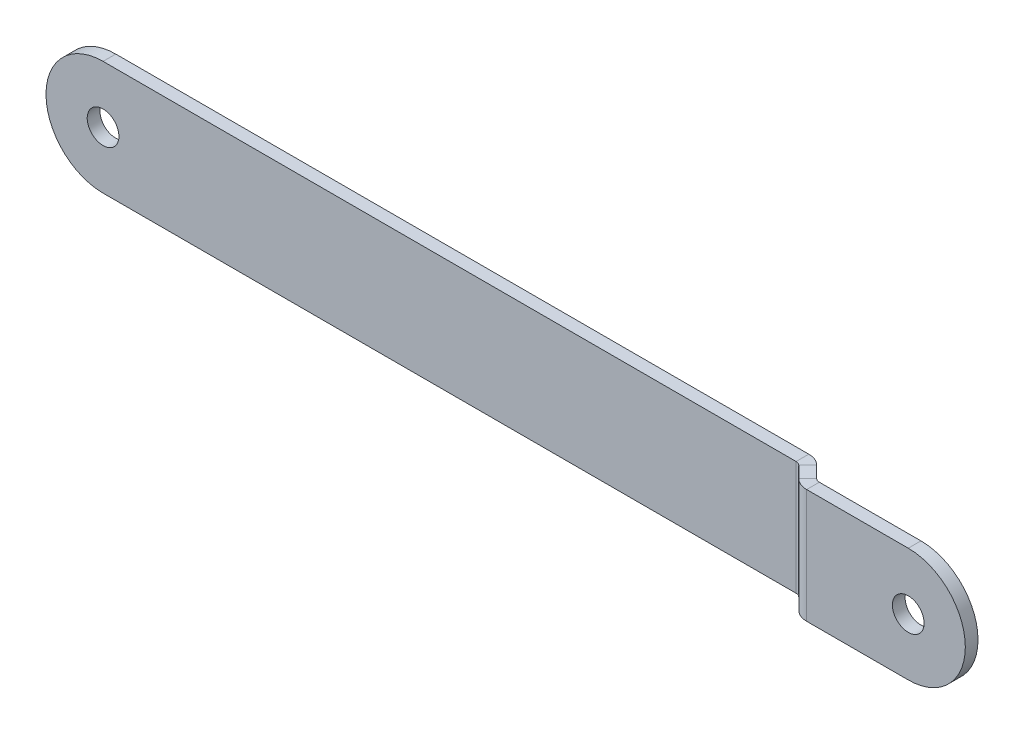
ISO-10303-21;
HEADER;
FILE_DESCRIPTION(('STEP AP214'),'2;1');
FILE_NAME('part.step','',(''),(''),'','','');
FILE_SCHEMA(('AUTOMOTIVE_DESIGN { 1 0 10303 214 1 1 1 1 }'));
ENDSEC;
DATA;
#1=APPLICATION_CONTEXT('core data for automotive mechanical design processes');
#2=APPLICATION_PROTOCOL_DEFINITION('international standard','automotive_design',2000,#1);
#3=PRODUCT_CONTEXT('',#1,'mechanical');
#4=PRODUCT('Part','Part','',(#3));
#5=PRODUCT_RELATED_PRODUCT_CATEGORY('part','',(#4));
#6=PRODUCT_DEFINITION_FORMATION('','',#4);
#7=PRODUCT_DEFINITION_CONTEXT('part definition',#1,'design');
#8=PRODUCT_DEFINITION('design','',#6,#7);
#9=PRODUCT_DEFINITION_SHAPE('','',#8);
#10=(LENGTH_UNIT() NAMED_UNIT(*) SI_UNIT(.MILLI.,.METRE.));
#11=(NAMED_UNIT(*) PLANE_ANGLE_UNIT() SI_UNIT($,.RADIAN.));
#12=(NAMED_UNIT(*) SI_UNIT($,.STERADIAN.) SOLID_ANGLE_UNIT());
#13=UNCERTAINTY_MEASURE_WITH_UNIT(LENGTH_MEASURE(1.E-05),#10,'distance_accuracy_value','');
#14=(GEOMETRIC_REPRESENTATION_CONTEXT(3) GLOBAL_UNCERTAINTY_ASSIGNED_CONTEXT((#13)) GLOBAL_UNIT_ASSIGNED_CONTEXT((#10,
#11,#12)) REPRESENTATION_CONTEXT('',''));
#15=CARTESIAN_POINT('',(0.,0.,0.));
#16=DIRECTION('',(0.,0.,1.));
#17=DIRECTION('',(1.,0.,0.));
#18=AXIS2_PLACEMENT_3D('',#15,#16,#17);
#19=CARTESIAN_POINT('',(-33.2464621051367,0.,-77.9742376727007));
#20=DIRECTION('',(-0.707106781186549,0.,0.707106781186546));
#21=DIRECTION('',(0.707106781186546,0.,0.707106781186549));
#22=AXIS2_PLACEMENT_3D('',#19,#20,#21);
#23=PLANE('',#22);
#24=DIRECTION('',(0.707106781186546,0.,0.707106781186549));
#25=VECTOR('',#24,1.);
#26=CARTESIAN_POINT('',(-33.2464621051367,-9.00000000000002,-77.9742376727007));
#27=LINE('',#26,#25);
#28=CARTESIAN_POINT('',(45.0206687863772,-9.,0.292893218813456));
#29=VERTEX_POINT('',#28);
#30=CARTESIAN_POINT('',(46.8490959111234,-9.,2.12132034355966));
#31=VERTEX_POINT('',#30);
#32=EDGE_CURVE('E204',#29,#31,#27,.T.);
#33=ORIENTED_EDGE('',*,*,#32,.T.);
#34=DIRECTION('',(0.,1.,0.));
#35=VECTOR('',#34,1.);
#36=CARTESIAN_POINT('',(46.8490959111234,0.,2.12132034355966));
#37=LINE('',#36,#35);
#38=CARTESIAN_POINT('',(46.8490959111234,9.00000000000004,2.12132034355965));
#39=VERTEX_POINT('',#38);
#40=EDGE_CURVE('E58',#31,#39,#37,.T.);
#41=ORIENTED_EDGE('',*,*,#40,.T.);
#42=DIRECTION('',(-0.707106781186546,0.,-0.707106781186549));
#43=VECTOR('',#42,1.);
#44=CARTESIAN_POINT('',(-33.2464621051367,9.00000000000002,-77.9742376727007));
#45=LINE('',#44,#43);
#46=CARTESIAN_POINT('',(45.0206687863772,9.00000000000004,0.292893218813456));
#47=VERTEX_POINT('',#46);
#48=EDGE_CURVE('E74',#39,#47,#45,.T.);
#49=ORIENTED_EDGE('',*,*,#48,.T.);
#50=DIRECTION('',(0.,1.,0.));
#51=VECTOR('',#50,1.);
#52=CARTESIAN_POINT('',(45.0206687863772,0.,0.292893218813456));
#53=LINE('',#52,#51);
#54=EDGE_CURVE('E244',#29,#47,#53,.T.);
#55=ORIENTED_EDGE('',*,*,#54,.F.);
#56=EDGE_LOOP('',(#33,#41,#49,#55));
#57=FACE_BOUND('',#56,.T.);
#58=ADVANCED_FACE('F49',(#57),#23,.T.);
#59=CARTESIAN_POINT('',(-31.8322485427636,-9.00000000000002,-79.3884512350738));
#60=DIRECTION('',(0.,-1.,0.));
#61=DIRECTION('',(0.707106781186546,0.,0.707106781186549));
#62=AXIS2_PLACEMENT_3D('',#59,#60,#61);
#63=PLANE('',#62);
#64=DIRECTION('',(0.707106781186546,0.,0.707106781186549));
#65=VECTOR('',#64,1.);
#66=CARTESIAN_POINT('',(-31.8322485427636,-9.00000000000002,-79.3884512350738));
#67=LINE('',#66,#65);
#68=CARTESIAN_POINT('',(46.4348823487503,-9.,-1.12132034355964));
#69=VERTEX_POINT('',#68);
#70=CARTESIAN_POINT('',(48.2633094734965,-9.,0.707106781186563));
#71=VERTEX_POINT('',#70);
#72=EDGE_CURVE('E256',#69,#71,#67,.T.);
#73=ORIENTED_EDGE('',*,*,#72,.T.);
#74=DIRECTION('',(-0.707106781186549,0.,0.707106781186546));
#75=VECTOR('',#74,1.);
#76=CARTESIAN_POINT('',(48.2633094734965,-9.,0.707106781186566));
#77=LINE('',#76,#75);
#78=EDGE_CURVE('E12',#71,#31,#77,.T.);
#79=ORIENTED_EDGE('',*,*,#78,.T.);
#80=ORIENTED_EDGE('',*,*,#32,.F.);
#81=DIRECTION('',(-0.707106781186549,0.,0.707106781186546));
#82=VECTOR('',#81,1.);
#83=CARTESIAN_POINT('',(46.4348823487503,-9.,-1.12132034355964));
#84=LINE('',#83,#82);
#85=EDGE_CURVE('E241',#69,#29,#84,.T.);
#86=ORIENTED_EDGE('',*,*,#85,.F.);
#87=EDGE_LOOP('',(#73,#79,#80,#86));
#88=FACE_BOUND('',#87,.T.);
#89=ADVANCED_FACE('F51',(#88),#63,.T.);
#90=CARTESIAN_POINT('',(-31.8322485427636,9.00000000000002,-79.3884512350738));
#91=DIRECTION('',(0.,1.,0.));
#92=DIRECTION('',(-0.707106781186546,0.,-0.707106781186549));
#93=AXIS2_PLACEMENT_3D('',#90,#91,#92);
#94=PLANE('',#93);
#95=ORIENTED_EDGE('',*,*,#48,.F.);
#96=DIRECTION('',(0.707106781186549,0.,-0.707106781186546));
#97=VECTOR('',#96,1.);
#98=CARTESIAN_POINT('',(48.2633094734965,9.00000000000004,0.707106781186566));
#99=LINE('',#98,#97);
#100=CARTESIAN_POINT('',(48.2633094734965,9.00000000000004,0.707106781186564));
#101=VERTEX_POINT('',#100);
#102=EDGE_CURVE('E252',#39,#101,#99,.T.);
#103=ORIENTED_EDGE('',*,*,#102,.T.);
#104=DIRECTION('',(-0.707106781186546,0.,-0.707106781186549));
#105=VECTOR('',#104,1.);
#106=CARTESIAN_POINT('',(-31.8322485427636,9.00000000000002,-79.3884512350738));
#107=LINE('',#106,#105);
#108=CARTESIAN_POINT('',(46.4348823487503,9.00000000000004,-1.12132034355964));
#109=VERTEX_POINT('',#108);
#110=EDGE_CURVE('E53',#101,#109,#107,.T.);
#111=ORIENTED_EDGE('',*,*,#110,.T.);
#112=DIRECTION('',(0.707106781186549,0.,-0.707106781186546));
#113=VECTOR('',#112,1.);
#114=CARTESIAN_POINT('',(46.4348823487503,9.00000000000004,-1.12132034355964));
#115=LINE('',#114,#113);
#116=EDGE_CURVE('E247',#47,#109,#115,.T.);
#117=ORIENTED_EDGE('',*,*,#116,.F.);
#118=EDGE_LOOP('',(#95,#103,#111,#117));
#119=FACE_BOUND('',#118,.T.);
#120=ADVANCED_FACE('F275',(#119),#94,.T.);
#121=CARTESIAN_POINT('',(-31.8322485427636,0.,-79.3884512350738));
#122=DIRECTION('',(-0.707106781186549,0.,0.707106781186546));
#123=DIRECTION('',(0.707106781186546,0.,0.707106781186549));
#124=AXIS2_PLACEMENT_3D('',#121,#122,#123);
#125=PLANE('',#124);
#126=DIRECTION('',(0.,1.,0.));
#127=VECTOR('',#126,1.);
#128=CARTESIAN_POINT('',(48.2633094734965,0.,0.707106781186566));
#129=LINE('',#128,#127);
#130=EDGE_CURVE('E250',#71,#101,#129,.T.);
#131=ORIENTED_EDGE('',*,*,#130,.F.);
#132=ORIENTED_EDGE('',*,*,#72,.F.);
#133=DIRECTION('',(0.,1.,0.));
#134=VECTOR('',#133,1.);
#135=CARTESIAN_POINT('',(46.4348823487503,0.,-1.12132034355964));
#136=LINE('',#135,#134);
#137=EDGE_CURVE('E239',#69,#109,#136,.T.);
#138=ORIENTED_EDGE('',*,*,#137,.T.);
#139=ORIENTED_EDGE('',*,*,#110,.F.);
#140=EDGE_LOOP('',(#131,#132,#138,#139));
#141=FACE_BOUND('',#140,.T.);
#142=ADVANCED_FACE('F271',(#141),#125,.F.);
#143=CARTESIAN_POINT('',(-65.,0.,-2.));
#144=DIRECTION('',(0.,0.,1.));
#145=DIRECTION('',(1.,0.,0.));
#146=AXIS2_PLACEMENT_3D('',#143,#144,#145);
#147=CYLINDRICAL_SURFACE('',#146,2.49999999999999);
#148=CARTESIAN_POINT('',(-65.,0.,-2.));
#149=DIRECTION('',(0.,0.,1.));
#150=DIRECTION('',(1.,0.,0.));
#151=AXIS2_PLACEMENT_3D('',#148,#149,#150);
#152=CIRCLE('',#151,2.49999999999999);
#153=CARTESIAN_POINT('',(-62.5,0.,-2.));
#154=VERTEX_POINT('',#153);
#155=EDGE_CURVE('E227',#154,#154,#152,.T.);
#156=ORIENTED_EDGE('',*,*,#155,.F.);
#157=EDGE_LOOP('',(#156));
#158=FACE_BOUND('',#157,.T.);
#159=CARTESIAN_POINT('',(-65.,0.,0.));
#160=DIRECTION('',(0.,0.,1.));
#161=DIRECTION('',(1.,0.,0.));
#162=AXIS2_PLACEMENT_3D('',#159,#160,#161);
#163=CIRCLE('',#162,2.49999999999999);
#164=CARTESIAN_POINT('',(-62.5,0.,0.));
#165=VERTEX_POINT('',#164);
#166=EDGE_CURVE('E235',#165,#165,#163,.T.);
#167=ORIENTED_EDGE('',*,*,#166,.T.);
#168=EDGE_LOOP('',(#167));
#169=FACE_BOUND('',#168,.T.);
#170=ADVANCED_FACE('F317',(#158,#169),#147,.F.);
#171=CARTESIAN_POINT('',(-65.,0.,-2.));
#172=DIRECTION('',(0.,0.,1.));
#173=DIRECTION('',(1.,0.,0.));
#174=AXIS2_PLACEMENT_3D('',#171,#172,#173);
#175=CYLINDRICAL_SURFACE('',#174,9.00000000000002);
#176=CARTESIAN_POINT('',(-65.,0.,0.));
#177=DIRECTION('',(0.,0.,1.));
#178=DIRECTION('',(1.,0.,0.));
#179=AXIS2_PLACEMENT_3D('',#176,#177,#178);
#180=CIRCLE('',#179,9.00000000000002);
#181=CARTESIAN_POINT('',(-65.,9.00000000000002,0.));
#182=VERTEX_POINT('',#181);
#183=CARTESIAN_POINT('',(-65.,-9.00000000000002,0.));
#184=VERTEX_POINT('',#183);
#185=EDGE_CURVE('E210',#182,#184,#180,.T.);
#186=ORIENTED_EDGE('',*,*,#185,.F.);
#187=DIRECTION('',(0.,0.,1.));
#188=VECTOR('',#187,1.);
#189=CARTESIAN_POINT('',(-65.,9.00000000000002,-2.));
#190=LINE('',#189,#188);
#191=CARTESIAN_POINT('',(-65.,9.00000000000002,-2.));
#192=VERTEX_POINT('',#191);
#193=EDGE_CURVE('E201',#192,#182,#190,.T.);
#194=ORIENTED_EDGE('',*,*,#193,.F.);
#195=CARTESIAN_POINT('',(-65.,0.,-2.));
#196=DIRECTION('',(0.,0.,1.));
#197=DIRECTION('',(1.,0.,0.));
#198=AXIS2_PLACEMENT_3D('',#195,#196,#197);
#199=CIRCLE('',#198,9.00000000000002);
#200=CARTESIAN_POINT('',(-65.,-9.00000000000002,-2.));
#201=VERTEX_POINT('',#200);
#202=EDGE_CURVE('E232',#192,#201,#199,.T.);
#203=ORIENTED_EDGE('',*,*,#202,.T.);
#204=DIRECTION('',(0.,0.,1.));
#205=VECTOR('',#204,1.);
#206=CARTESIAN_POINT('',(-65.,-9.00000000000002,-2.));
#207=LINE('',#206,#205);
#208=EDGE_CURVE('E230',#201,#184,#207,.T.);
#209=ORIENTED_EDGE('',*,*,#208,.T.);
#210=EDGE_LOOP('',(#186,#194,#203,#209));
#211=FACE_BOUND('',#210,.T.);
#212=ADVANCED_FACE('F334',(#211),#175,.T.);
#213=CARTESIAN_POINT('',(-65.,0.,-2.));
#214=DIRECTION('',(0.,0.,1.));
#215=DIRECTION('',(1.,0.,0.));
#216=AXIS2_PLACEMENT_3D('',#213,#214,#215);
#217=PLANE('',#216);
#218=DIRECTION('',(0.,1.,0.));
#219=VECTOR('',#218,1.);
#220=CARTESIAN_POINT('',(44.3135620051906,0.,-2.));
#221=LINE('',#220,#219);
#222=CARTESIAN_POINT('',(44.3135620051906,-9.,-2.));
#223=VERTEX_POINT('',#222);
#224=CARTESIAN_POINT('',(44.3135620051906,9.00000000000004,-2.));
#225=VERTEX_POINT('',#224);
#226=EDGE_CURVE('E197',#223,#225,#221,.T.);
#227=ORIENTED_EDGE('',*,*,#226,.F.);
#228=DIRECTION('',(1.,0.,0.));
#229=VECTOR('',#228,1.);
#230=CARTESIAN_POINT('',(-65.,-9.00000000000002,-2.));
#231=LINE('',#230,#229);
#232=EDGE_CURVE('E224',#201,#223,#231,.T.);
#233=ORIENTED_EDGE('',*,*,#232,.F.);
#234=ORIENTED_EDGE('',*,*,#202,.F.);
#235=DIRECTION('',(-1.,0.,0.));
#236=VECTOR('',#235,1.);
#237=CARTESIAN_POINT('',(-65.,9.00000000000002,-2.));
#238=LINE('',#237,#236);
#239=EDGE_CURVE('E205',#225,#192,#238,.T.);
#240=ORIENTED_EDGE('',*,*,#239,.F.);
#241=EDGE_LOOP('',(#227,#233,#234,#240));
#242=FACE_BOUND('',#241,.T.);
#243=ORIENTED_EDGE('',*,*,#155,.T.);
#244=EDGE_LOOP('',(#243));
#245=FACE_BOUND('',#244,.T.);
#246=ADVANCED_FACE('F330',(#242,#245),#217,.F.);
#247=CARTESIAN_POINT('',(-65.,-9.00000000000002,-2.));
#248=DIRECTION('',(0.,-1.,0.));
#249=DIRECTION('',(1.,0.,0.));
#250=AXIS2_PLACEMENT_3D('',#247,#248,#249);
#251=PLANE('',#250);
#252=ORIENTED_EDGE('',*,*,#232,.T.);
#253=DIRECTION('',(0.,0.,1.));
#254=VECTOR('',#253,1.);
#255=CARTESIAN_POINT('',(44.3135620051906,-9.,-2.));
#256=LINE('',#255,#254);
#257=CARTESIAN_POINT('',(44.3135620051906,-9.,0.));
#258=VERTEX_POINT('',#257);
#259=EDGE_CURVE('E221',#223,#258,#256,.T.);
#260=ORIENTED_EDGE('',*,*,#259,.T.);
#261=DIRECTION('',(1.,0.,0.));
#262=VECTOR('',#261,1.);
#263=CARTESIAN_POINT('',(-65.,-9.00000000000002,0.));
#264=LINE('',#263,#262);
#265=EDGE_CURVE('E218',#184,#258,#264,.T.);
#266=ORIENTED_EDGE('',*,*,#265,.F.);
#267=ORIENTED_EDGE('',*,*,#208,.F.);
#268=EDGE_LOOP('',(#252,#260,#266,#267));
#269=FACE_BOUND('',#268,.T.);
#270=ADVANCED_FACE('F326',(#269),#251,.T.);
#271=CARTESIAN_POINT('',(-65.,0.,0.));
#272=DIRECTION('',(0.,0.,1.));
#273=DIRECTION('',(1.,0.,0.));
#274=AXIS2_PLACEMENT_3D('',#271,#272,#273);
#275=PLANE('',#274);
#276=ORIENTED_EDGE('',*,*,#166,.F.);
#277=EDGE_LOOP('',(#276));
#278=FACE_BOUND('',#277,.T.);
#279=ORIENTED_EDGE('',*,*,#265,.T.);
#280=DIRECTION('',(0.,1.,0.));
#281=VECTOR('',#280,1.);
#282=CARTESIAN_POINT('',(44.3135620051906,0.,0.));
#283=LINE('',#282,#281);
#284=CARTESIAN_POINT('',(44.3135620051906,9.00000000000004,0.));
#285=VERTEX_POINT('',#284);
#286=EDGE_CURVE('E215',#258,#285,#283,.T.);
#287=ORIENTED_EDGE('',*,*,#286,.T.);
#288=DIRECTION('',(-1.,0.,0.));
#289=VECTOR('',#288,1.);
#290=CARTESIAN_POINT('',(-65.,9.00000000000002,0.));
#291=LINE('',#290,#289);
#292=EDGE_CURVE('E213',#285,#182,#291,.T.);
#293=ORIENTED_EDGE('',*,*,#292,.T.);
#294=ORIENTED_EDGE('',*,*,#185,.T.);
#295=EDGE_LOOP('',(#279,#287,#293,#294));
#296=FACE_BOUND('',#295,.T.);
#297=ADVANCED_FACE('F322',(#278,#296),#275,.T.);
#298=CARTESIAN_POINT('',(-65.,9.00000000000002,-2.));
#299=DIRECTION('',(0.,1.,0.));
#300=DIRECTION('',(-1.,0.,0.));
#301=AXIS2_PLACEMENT_3D('',#298,#299,#300);
#302=PLANE('',#301);
#303=ORIENTED_EDGE('',*,*,#292,.F.);
#304=DIRECTION('',(0.,0.,-1.));
#305=VECTOR('',#304,1.);
#306=CARTESIAN_POINT('',(44.3135620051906,9.00000000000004,-2.));
#307=LINE('',#306,#305);
#308=EDGE_CURVE('E207',#285,#225,#307,.T.);
#309=ORIENTED_EDGE('',*,*,#308,.T.);
#310=ORIENTED_EDGE('',*,*,#239,.T.);
#311=ORIENTED_EDGE('',*,*,#193,.T.);
#312=EDGE_LOOP('',(#303,#309,#310,#311));
#313=FACE_BOUND('',#312,.T.);
#314=ADVANCED_FACE('F318',(#313),#302,.T.);
#315=CARTESIAN_POINT('',(44.3135620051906,-9.,1.));
#316=DIRECTION('',(0.,-1.,0.));
#317=DIRECTION('',(0.,0.,-1.));
#318=AXIS2_PLACEMENT_3D('',#315,#316,#317);
#319=PLANE('',#318);
#320=ORIENTED_EDGE('',*,*,#85,.T.);
#321=CARTESIAN_POINT('',(44.3135620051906,-9.,1.));
#322=DIRECTION('',(0.,-1.,0.));
#323=DIRECTION('',(0.,0.,-1.));
#324=AXIS2_PLACEMENT_3D('',#321,#322,#323);
#325=CIRCLE('',#324,1.);
#326=EDGE_CURVE('E186',#29,#258,#325,.F.);
#327=ORIENTED_EDGE('',*,*,#326,.T.);
#328=ORIENTED_EDGE('',*,*,#259,.F.);
#329=CARTESIAN_POINT('',(44.3135620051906,-9.,1.));
#330=DIRECTION('',(0.,1.,0.));
#331=DIRECTION('',(0.,0.,-1.));
#332=AXIS2_PLACEMENT_3D('',#329,#330,#331);
#333=CIRCLE('',#332,3.);
#334=EDGE_CURVE('E190',#69,#223,#333,.T.);
#335=ORIENTED_EDGE('',*,*,#334,.F.);
#336=EDGE_LOOP('',(#320,#327,#328,#335));
#337=FACE_BOUND('',#336,.T.);
#338=ADVANCED_FACE('F321',(#337),#319,.T.);
#339=CARTESIAN_POINT('',(44.3135620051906,9.00000000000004,1.));
#340=DIRECTION('',(0.,1.,0.));
#341=DIRECTION('',(0.,0.,1.));
#342=AXIS2_PLACEMENT_3D('',#339,#340,#341);
#343=PLANE('',#342);
#344=ORIENTED_EDGE('',*,*,#308,.F.);
#345=CARTESIAN_POINT('',(44.3135620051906,9.00000000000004,1.));
#346=DIRECTION('',(0.,-1.,0.));
#347=DIRECTION('',(0.,0.,-1.));
#348=AXIS2_PLACEMENT_3D('',#345,#346,#347);
#349=CIRCLE('',#348,1.);
#350=EDGE_CURVE('E194',#285,#47,#349,.T.);
#351=ORIENTED_EDGE('',*,*,#350,.T.);
#352=ORIENTED_EDGE('',*,*,#116,.T.);
#353=CARTESIAN_POINT('',(44.3135620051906,9.00000000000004,1.));
#354=DIRECTION('',(0.,-1.,0.));
#355=DIRECTION('',(0.,0.,1.));
#356=AXIS2_PLACEMENT_3D('',#353,#354,#355);
#357=CIRCLE('',#356,3.);
#358=EDGE_CURVE('E193',#225,#109,#357,.T.);
#359=ORIENTED_EDGE('',*,*,#358,.F.);
#360=EDGE_LOOP('',(#344,#351,#352,#359));
#361=FACE_BOUND('',#360,.T.);
#362=ADVANCED_FACE('F344',(#361),#343,.T.);
#363=CARTESIAN_POINT('',(44.3135620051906,18.162730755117,1.));
#364=DIRECTION('',(0.,-1.,0.));
#365=DIRECTION('',(0.,0.,-1.));
#366=AXIS2_PLACEMENT_3D('',#363,#364,#365);
#367=CYLINDRICAL_SURFACE('',#366,3.);
#368=ORIENTED_EDGE('',*,*,#358,.T.);
#369=ORIENTED_EDGE('',*,*,#137,.F.);
#370=ORIENTED_EDGE('',*,*,#334,.T.);
#371=ORIENTED_EDGE('',*,*,#226,.T.);
#372=EDGE_LOOP('',(#368,#369,#370,#371));
#373=FACE_BOUND('',#372,.T.);
#374=ADVANCED_FACE('F348',(#373),#367,.T.);
#375=CARTESIAN_POINT('',(44.3135620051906,18.162730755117,1.));
#376=DIRECTION('',(0.,-1.,0.));
#377=DIRECTION('',(0.,0.,-1.));
#378=AXIS2_PLACEMENT_3D('',#375,#376,#377);
#379=CYLINDRICAL_SURFACE('',#378,1.);
#380=ORIENTED_EDGE('',*,*,#350,.F.);
#381=ORIENTED_EDGE('',*,*,#286,.F.);
#382=ORIENTED_EDGE('',*,*,#326,.F.);
#383=ORIENTED_EDGE('',*,*,#54,.T.);
#384=EDGE_LOOP('',(#380,#381,#382,#383));
#385=FACE_BOUND('',#384,.T.);
#386=ADVANCED_FACE('F350',(#385),#379,.F.);
#387=CARTESIAN_POINT('',(48.970416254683,-9.,0.));
#388=DIRECTION('',(0.,1.,0.));
#389=DIRECTION('',(0.,0.,1.));
#390=AXIS2_PLACEMENT_3D('',#387,#388,#389);
#391=PLANE('',#390);
#392=DIRECTION('',(0.,0.,1.));
#393=VECTOR('',#392,1.);
#394=CARTESIAN_POINT('',(48.970416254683,-9.,1.00000000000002));
#395=LINE('',#394,#393);
#396=CARTESIAN_POINT('',(48.970416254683,-9.,1.00000000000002));
#397=VERTEX_POINT('',#396);
#398=CARTESIAN_POINT('',(48.970416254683,-9.,3.00000000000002));
#399=VERTEX_POINT('',#398);
#400=EDGE_CURVE('E148',#397,#399,#395,.T.);
#401=ORIENTED_EDGE('',*,*,#400,.T.);
#402=CARTESIAN_POINT('',(48.970416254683,-9.,0.));
#403=DIRECTION('',(0.,-1.,0.));
#404=DIRECTION('',(0.,0.,-1.));
#405=AXIS2_PLACEMENT_3D('',#402,#403,#404);
#406=CIRCLE('',#405,3.);
#407=EDGE_CURVE('E66',#399,#31,#406,.T.);
#408=ORIENTED_EDGE('',*,*,#407,.T.);
#409=ORIENTED_EDGE('',*,*,#78,.F.);
#410=CARTESIAN_POINT('',(48.970416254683,-9.,0.));
#411=DIRECTION('',(0.,-1.,0.));
#412=DIRECTION('',(0.,0.,1.));
#413=AXIS2_PLACEMENT_3D('',#410,#411,#412);
#414=CIRCLE('',#413,1.);
#415=EDGE_CURVE('E179',#397,#71,#414,.T.);
#416=ORIENTED_EDGE('',*,*,#415,.F.);
#417=EDGE_LOOP('',(#401,#408,#409,#416));
#418=FACE_BOUND('',#417,.T.);
#419=ADVANCED_FACE('F262',(#418),#391,.F.);
#420=CARTESIAN_POINT('',(48.970416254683,9.00000000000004,0.));
#421=DIRECTION('',(0.,-1.,0.));
#422=DIRECTION('',(0.,0.,-1.));
#423=AXIS2_PLACEMENT_3D('',#420,#421,#422);
#424=PLANE('',#423);
#425=ORIENTED_EDGE('',*,*,#102,.F.);
#426=CARTESIAN_POINT('',(48.970416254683,9.00000000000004,0.));
#427=DIRECTION('',(0.,-1.,0.));
#428=DIRECTION('',(0.,0.,-1.));
#429=AXIS2_PLACEMENT_3D('',#426,#427,#428);
#430=CIRCLE('',#429,3.);
#431=CARTESIAN_POINT('',(48.970416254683,9.00000000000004,3.00000000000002));
#432=VERTEX_POINT('',#431);
#433=EDGE_CURVE('E183',#39,#432,#430,.F.);
#434=ORIENTED_EDGE('',*,*,#433,.T.);
#435=DIRECTION('',(0.,0.,-1.));
#436=VECTOR('',#435,1.);
#437=CARTESIAN_POINT('',(48.970416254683,9.00000000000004,1.00000000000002));
#438=LINE('',#437,#436);
#439=CARTESIAN_POINT('',(48.970416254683,9.00000000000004,1.00000000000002));
#440=VERTEX_POINT('',#439);
#441=EDGE_CURVE('E167',#432,#440,#438,.T.);
#442=ORIENTED_EDGE('',*,*,#441,.T.);
#443=CARTESIAN_POINT('',(48.970416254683,9.00000000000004,0.));
#444=DIRECTION('',(0.,1.,0.));
#445=DIRECTION('',(0.,0.,-1.));
#446=AXIS2_PLACEMENT_3D('',#443,#444,#445);
#447=CIRCLE('',#446,1.);
#448=EDGE_CURVE('E182',#101,#440,#447,.T.);
#449=ORIENTED_EDGE('',*,*,#448,.F.);
#450=EDGE_LOOP('',(#425,#434,#442,#449));
#451=FACE_BOUND('',#450,.T.);
#452=ADVANCED_FACE('F278',(#451),#424,.F.);
#453=CARTESIAN_POINT('',(48.970416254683,18.3132818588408,0.));
#454=DIRECTION('',(0.,-1.,0.));
#455=DIRECTION('',(0.,0.,-1.));
#456=AXIS2_PLACEMENT_3D('',#453,#454,#455);
#457=CYLINDRICAL_SURFACE('',#456,1.);
#458=ORIENTED_EDGE('',*,*,#448,.T.);
#459=DIRECTION('',(0.,1.,0.));
#460=VECTOR('',#459,1.);
#461=CARTESIAN_POINT('',(48.970416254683,0.,1.00000000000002));
#462=LINE('',#461,#460);
#463=EDGE_CURVE('E268',#397,#440,#462,.T.);
#464=ORIENTED_EDGE('',*,*,#463,.F.);
#465=ORIENTED_EDGE('',*,*,#415,.T.);
#466=ORIENTED_EDGE('',*,*,#130,.T.);
#467=EDGE_LOOP('',(#458,#464,#465,#466));
#468=FACE_BOUND('',#467,.T.);
#469=ADVANCED_FACE('F266',(#468),#457,.F.);
#470=CARTESIAN_POINT('',(48.970416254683,18.3132818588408,0.));
#471=DIRECTION('',(0.,-1.,0.));
#472=DIRECTION('',(0.,0.,-1.));
#473=AXIS2_PLACEMENT_3D('',#470,#471,#472);
#474=CYLINDRICAL_SURFACE('',#473,3.);
#475=ORIENTED_EDGE('',*,*,#433,.F.);
#476=ORIENTED_EDGE('',*,*,#40,.F.);
#477=ORIENTED_EDGE('',*,*,#407,.F.);
#478=DIRECTION('',(0.,1.,0.));
#479=VECTOR('',#478,1.);
#480=CARTESIAN_POINT('',(48.970416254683,0.,3.00000000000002));
#481=LINE('',#480,#479);
#482=EDGE_CURVE('E172',#399,#432,#481,.T.);
#483=ORIENTED_EDGE('',*,*,#482,.T.);
#484=EDGE_LOOP('',(#475,#476,#477,#483));
#485=FACE_BOUND('',#484,.T.);
#486=ADVANCED_FACE('F280',(#485),#474,.T.);
#487=CARTESIAN_POINT('',(65.,0.,1.00000000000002));
#488=DIRECTION('',(0.,0.,1.));
#489=DIRECTION('',(1.,0.,0.));
#490=AXIS2_PLACEMENT_3D('',#487,#488,#489);
#491=CYLINDRICAL_SURFACE('',#490,9.00000000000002);
#492=CARTESIAN_POINT('',(65.,0.,3.00000000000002));
#493=DIRECTION('',(0.,0.,1.));
#494=DIRECTION('',(1.,0.,0.));
#495=AXIS2_PLACEMENT_3D('',#492,#493,#494);
#496=CIRCLE('',#495,9.00000000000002);
#497=CARTESIAN_POINT('',(65.,-9.,3.00000000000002));
#498=VERTEX_POINT('',#497);
#499=CARTESIAN_POINT('',(65.,9.00000000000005,3.00000000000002));
#500=VERTEX_POINT('',#499);
#501=EDGE_CURVE('E161',#498,#500,#496,.T.);
#502=ORIENTED_EDGE('',*,*,#501,.F.);
#503=DIRECTION('',(0.,0.,1.));
#504=VECTOR('',#503,1.);
#505=CARTESIAN_POINT('',(65.,-9.,1.00000000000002));
#506=LINE('',#505,#504);
#507=CARTESIAN_POINT('',(65.,-9.,1.00000000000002));
#508=VERTEX_POINT('',#507);
#509=EDGE_CURVE('E146',#508,#498,#506,.T.);
#510=ORIENTED_EDGE('',*,*,#509,.F.);
#511=CARTESIAN_POINT('',(65.,0.,1.00000000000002));
#512=DIRECTION('',(0.,0.,1.));
#513=DIRECTION('',(1.,0.,0.));
#514=AXIS2_PLACEMENT_3D('',#511,#512,#513);
#515=CIRCLE('',#514,9.00000000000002);
#516=CARTESIAN_POINT('',(65.,9.00000000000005,1.00000000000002));
#517=VERTEX_POINT('',#516);
#518=EDGE_CURVE('E159',#508,#517,#515,.T.);
#519=ORIENTED_EDGE('',*,*,#518,.T.);
#520=DIRECTION('',(0.,0.,1.));
#521=VECTOR('',#520,1.);
#522=CARTESIAN_POINT('',(65.,9.00000000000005,1.00000000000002));
#523=LINE('',#522,#521);
#524=EDGE_CURVE('E166',#517,#500,#523,.T.);
#525=ORIENTED_EDGE('',*,*,#524,.T.);
#526=EDGE_LOOP('',(#502,#510,#519,#525));
#527=FACE_BOUND('',#526,.T.);
#528=ADVANCED_FACE('F157',(#527),#491,.T.);
#529=CARTESIAN_POINT('',(65.,0.,1.00000000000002));
#530=DIRECTION('',(0.,0.,1.));
#531=DIRECTION('',(1.,0.,0.));
#532=AXIS2_PLACEMENT_3D('',#529,#530,#531);
#533=CYLINDRICAL_SURFACE('',#532,2.49999999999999);
#534=CARTESIAN_POINT('',(65.,0.,1.00000000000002));
#535=DIRECTION('',(0.,0.,1.));
#536=DIRECTION('',(1.,0.,0.));
#537=AXIS2_PLACEMENT_3D('',#534,#535,#536);
#538=CIRCLE('',#537,2.49999999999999);
#539=CARTESIAN_POINT('',(67.5,0.,1.00000000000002));
#540=VERTEX_POINT('',#539);
#541=EDGE_CURVE('E291',#540,#540,#538,.T.);
#542=ORIENTED_EDGE('',*,*,#541,.F.);
#543=EDGE_LOOP('',(#542));
#544=FACE_BOUND('',#543,.T.);
#545=CARTESIAN_POINT('',(65.,0.,3.00000000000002));
#546=DIRECTION('',(0.,0.,1.));
#547=DIRECTION('',(1.,0.,0.));
#548=AXIS2_PLACEMENT_3D('',#545,#546,#547);
#549=CIRCLE('',#548,2.49999999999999);
#550=CARTESIAN_POINT('',(67.5,0.,3.00000000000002));
#551=VERTEX_POINT('',#550);
#552=EDGE_CURVE('E169',#551,#551,#549,.T.);
#553=ORIENTED_EDGE('',*,*,#552,.T.);
#554=EDGE_LOOP('',(#553));
#555=FACE_BOUND('',#554,.T.);
#556=ADVANCED_FACE('F299',(#544,#555),#533,.F.);
#557=CARTESIAN_POINT('',(-65.674684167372,0.,1.00000000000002));
#558=DIRECTION('',(0.,0.,1.));
#559=DIRECTION('',(1.,0.,0.));
#560=AXIS2_PLACEMENT_3D('',#557,#558,#559);
#561=PLANE('',#560);
#562=ORIENTED_EDGE('',*,*,#541,.T.);
#563=EDGE_LOOP('',(#562));
#564=FACE_BOUND('',#563,.T.);
#565=DIRECTION('',(1.,0.,0.));
#566=VECTOR('',#565,1.);
#567=CARTESIAN_POINT('',(-65.674684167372,-9.00000000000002,1.00000000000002));
#568=LINE('',#567,#566);
#569=EDGE_CURVE('E143',#397,#508,#568,.T.);
#570=ORIENTED_EDGE('',*,*,#569,.F.);
#571=ORIENTED_EDGE('',*,*,#463,.T.);
#572=DIRECTION('',(-1.,0.,0.));
#573=VECTOR('',#572,1.);
#574=CARTESIAN_POINT('',(-65.674684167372,9.00000000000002,1.00000000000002));
#575=LINE('',#574,#573);
#576=EDGE_CURVE('E164',#517,#440,#575,.T.);
#577=ORIENTED_EDGE('',*,*,#576,.F.);
#578=ORIENTED_EDGE('',*,*,#518,.F.);
#579=EDGE_LOOP('',(#570,#571,#577,#578));
#580=FACE_BOUND('',#579,.T.);
#581=ADVANCED_FACE('F163',(#564,#580),#561,.F.);
#582=CARTESIAN_POINT('',(-65.674684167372,9.00000000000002,1.00000000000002));
#583=DIRECTION('',(0.,1.,0.));
#584=DIRECTION('',(-1.,0.,0.));
#585=AXIS2_PLACEMENT_3D('',#582,#583,#584);
#586=PLANE('',#585);
#587=ORIENTED_EDGE('',*,*,#441,.F.);
#588=DIRECTION('',(-1.,0.,0.));
#589=VECTOR('',#588,1.);
#590=CARTESIAN_POINT('',(-65.674684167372,9.00000000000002,3.00000000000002));
#591=LINE('',#590,#589);
#592=EDGE_CURVE('E153',#500,#432,#591,.T.);
#593=ORIENTED_EDGE('',*,*,#592,.F.);
#594=ORIENTED_EDGE('',*,*,#524,.F.);
#595=ORIENTED_EDGE('',*,*,#576,.T.);
#596=EDGE_LOOP('',(#587,#593,#594,#595));
#597=FACE_BOUND('',#596,.T.);
#598=ADVANCED_FACE('F289',(#597),#586,.T.);
#599=CARTESIAN_POINT('',(-65.674684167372,0.,3.00000000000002));
#600=DIRECTION('',(0.,0.,1.));
#601=DIRECTION('',(1.,0.,0.));
#602=AXIS2_PLACEMENT_3D('',#599,#600,#601);
#603=PLANE('',#602);
#604=ORIENTED_EDGE('',*,*,#482,.F.);
#605=DIRECTION('',(1.,0.,0.));
#606=VECTOR('',#605,1.);
#607=CARTESIAN_POINT('',(-65.674684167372,-9.00000000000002,3.00000000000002));
#608=LINE('',#607,#606);
#609=EDGE_CURVE('E285',#399,#498,#608,.T.);
#610=ORIENTED_EDGE('',*,*,#609,.T.);
#611=ORIENTED_EDGE('',*,*,#501,.T.);
#612=ORIENTED_EDGE('',*,*,#592,.T.);
#613=EDGE_LOOP('',(#604,#610,#611,#612));
#614=FACE_BOUND('',#613,.T.);
#615=ORIENTED_EDGE('',*,*,#552,.F.);
#616=EDGE_LOOP('',(#615));
#617=FACE_BOUND('',#616,.T.);
#618=ADVANCED_FACE('F283',(#614,#617),#603,.T.);
#619=CARTESIAN_POINT('',(-65.674684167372,-9.00000000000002,1.00000000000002));
#620=DIRECTION('',(0.,-1.,0.));
#621=DIRECTION('',(1.,0.,0.));
#622=AXIS2_PLACEMENT_3D('',#619,#620,#621);
#623=PLANE('',#622);
#624=ORIENTED_EDGE('',*,*,#400,.F.);
#625=ORIENTED_EDGE('',*,*,#569,.T.);
#626=ORIENTED_EDGE('',*,*,#509,.T.);
#627=ORIENTED_EDGE('',*,*,#609,.F.);
#628=EDGE_LOOP('',(#624,#625,#626,#627));
#629=FACE_BOUND('',#628,.T.);
#630=ADVANCED_FACE('F145',(#629),#623,.T.);
#631=CLOSED_SHELL('',(#58,#89,#120,#142,#170,#212,#246,#270,#297,#314,#338,#362,#374,#386,#419,
#452,#469,#486,#528,#556,#581,#598,#618,#630));
#632=MANIFOLD_SOLID_BREP('B2',#631);
#633=ADVANCED_BREP_SHAPE_REPRESENTATION('',(#18,#632),#14);
#634=SHAPE_DEFINITION_REPRESENTATION(#9,#633);
ENDSEC;
END-ISO-10303-21;
